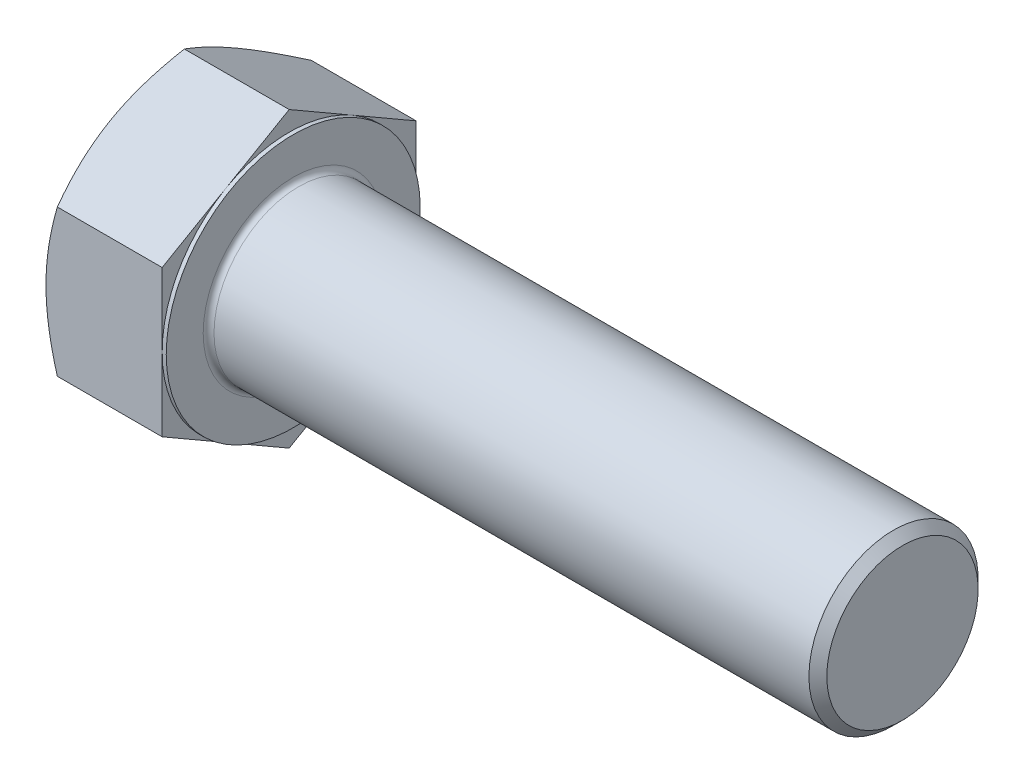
from build123d import *

# Parameters (mm, degrees)
BASEHEAD_DEPTH = 11.2776
SKETCH4_W      = 0.381
SKETCH4_H      = 27.242885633
HEADFILLET_R   = 0.508


with BuildPart() as part:
    # Sketch1 → BaseHead (new body)
    with BuildSketch(Plane(origin=(0, 0, 0), x_dir=(0, 0, -1), z_dir=(1, 0, 0))):
        Polygon((11.9126, 6.877742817), (11.9126, -6.877742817), (0, -13.755485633), (-11.9126, -6.877742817), (-11.9126, 6.877742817), (0, 13.755485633), align=None)
    extrude(amount=BASEHEAD_DEPTH)

    # BodySke → BaseBody (revolve)
    with BuildSketch(Plane.XY, mode=Mode.PRIVATE) as basebody_sk:
        Polygon((0, 0), (68.4276, 0), (68.4276, 7.09803), (67.58813, 7.9375), (0, 7.9375), align=None)
    revolve(basebody_sk.sketch.rotate(Axis((0, 0, 0), (1, 0, 0)), 90), axis=Axis((0, 0, 0), (1, 0, 0)))

    # Sketch3 → HeadChamfer (revolve, cut)
    with BuildSketch(Plane.XY):
        Polygon((0, 11.9126), (4.730164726, 20.105485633), (4.730164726, 26.455485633), (-12.7, 26.455485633), (-12.7, 11.9126), align=None)
    revolve(axis=Axis((0, 0, 0), (1, 0, 0)), mode=Mode.SUBTRACT)

    # Sketch4 → BearingFace (revolve, cut)
    with BuildSketch(Plane.XY, mode=Mode.PRIVATE) as bearingface_sk:
        with Locations((11.0871, 25.534042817)):
            Rectangle(SKETCH4_W, SKETCH4_H)
    revolve(bearingface_sk.sketch.rotate(Axis((0, 0, 0), (1, 0, 0)), 270), axis=Axis((0, 0, 0), (1, 0, 0)), mode=Mode.SUBTRACT)

    # HeadFillet
    headfillet_edges = [part.edges().sort_by_distance(p)[0] for p in [
        (11.2776, 0, -7.9375),
    ]]
    fillet(headfillet_edges, radius=HEADFILLET_R)


solid = part.part
